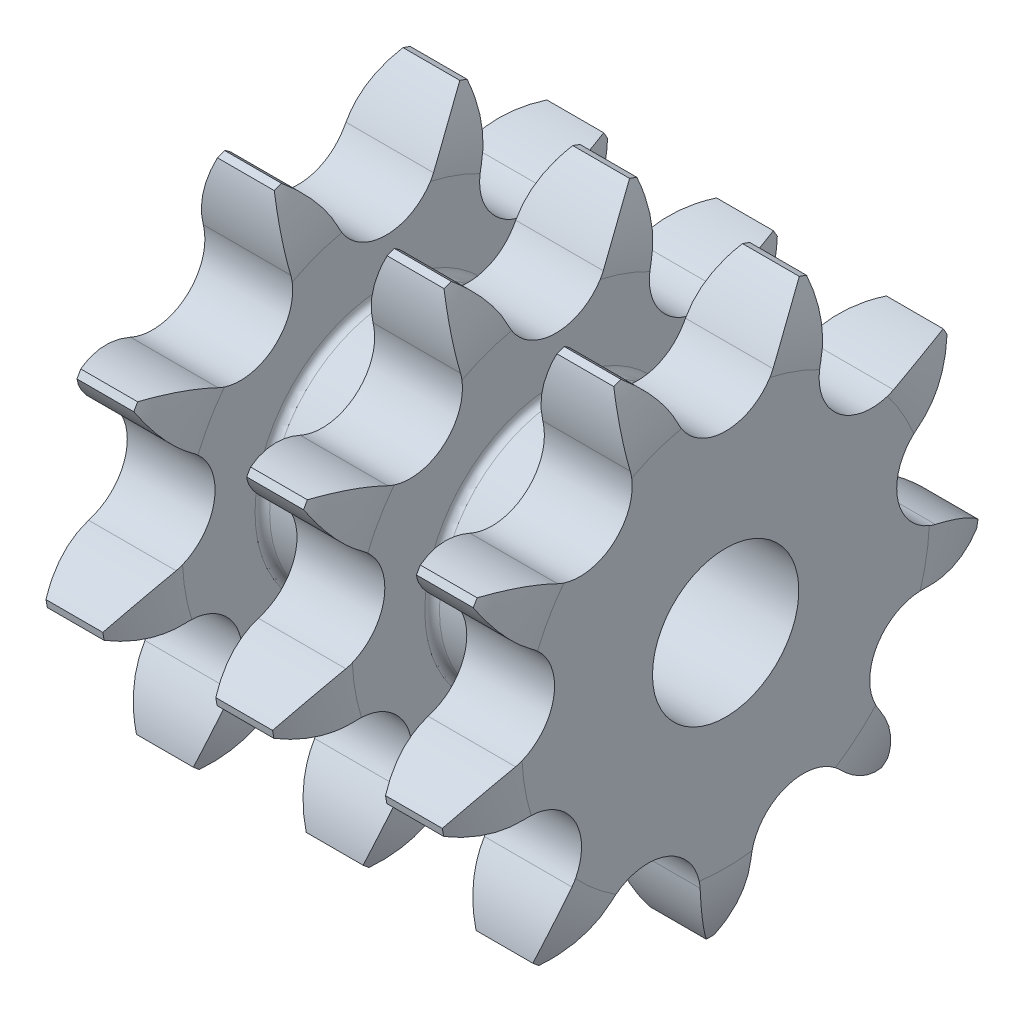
from build123d import *

# Parameters (mm, degrees)
GROOVES_COUNT   = 2
GROOVES_PITCH   = 13.92
TOOTHCUT_DEPTH  = 48.093600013
TEETHCUTS_COUNT = 9
TEETHCUTS_ANGLE = 320
BORSKE_R        = 6
BORE_DEPTH      = 37.2405


with BuildPart() as part:
    # BasProSke → Base-Revolve (revolve)
    with BuildSketch(Plane(origin=(0, 0, 0), x_dir=(1, 0, 0), z_dir=(0, 1, 0)), mode=Mode.PRIVATE) as base_revolve_sk:
        with BuildLine():
            Line((0, 0), (0, 16.712856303))
            ThreePointArc((0, 16.712856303), (0.321571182, 19.552662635), (1.27, 22.248657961))
            Line((1.27, 22.248657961), (33.77, 22.248657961))
            ThreePointArc((33.77, 22.248657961), (34.718428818, 19.552662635), (35.04, 16.712856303))
            Line((35.04, 16.712856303), (35.04, 0))
            Line((35.04, 0), (0, 0))
        make_face()
    revolve(base_revolve_sk.sketch.rotate(Axis((-10, 0, 0), (1, 0, 0)), 180), axis=Axis((-10, 0, 0), (1, 0, 0)))

    # GrvSke → Groove (revolve, cut)
    with BuildSketch(Plane(origin=(0, 0, 0), x_dir=(1, 0, 0), z_dir=(0, 1, 0)), mode=Mode.PRIVATE) as groove_sk:
        with BuildLine():
            Line((7.2, 16.712856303), (7.2, 10.751481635))
            ThreePointArc((7.2, 10.751481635), (7.375735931, 10.327217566), (7.8, 10.151481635))
            Line((7.8, 10.151481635), (13.32, 10.151481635))
            ThreePointArc((13.32, 10.151481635), (13.744264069, 10.327217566), (13.92, 10.751481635))
            Line((13.92, 10.751481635), (13.92, 16.712856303))
            ThreePointArc((13.92, 16.712856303), (14.241571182, 19.552662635), (15.19, 22.248657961))
            Line((15.19, 22.248657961), (5.93, 22.248657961))
            ThreePointArc((5.93, 22.248657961), (6.878428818, 19.552662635), (7.2, 16.712856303))
        make_face()
    groove = revolve(groove_sk.sketch.rotate(Axis((0, 0, 0), (1, 0, 0)), 180), axis=Axis((0, 0, 0), (1, 0, 0)), mode=Mode.SUBTRACT)

    # Grooves: Groove ×2
    with Locations(*[(i * GROOVES_PITCH, 0, 0) for i in range(1, GROOVES_COUNT)]):
        add(groove, mode=Mode.SUBTRACT)

    # TooCutSke → ToothCut (cut, through all)
    with BuildSketch(Plane(origin=(0, 0, 0), x_dir=(0, 0, -1), z_dir=(1, 0, 0))):
        with BuildLine():
            ThreePointArc((3.89490303, 16.792484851), (5.53909395, 19.346647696), (7.807509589, 21.366895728))
            ThreePointArc((7.807509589, 21.366895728), (0, 22.748657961), (-7.807509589, 21.366895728))
            ThreePointArc((-7.807509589, 21.366895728), (-5.53909395, 19.346647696), (-3.89490303, 16.792484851))
            ThreePointArc((-3.89490303, 16.792484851), (0, 14.311157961), (3.89490303, 16.792484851))
        make_face()
    toothcut = extrude(amount=TOOTHCUT_DEPTH, mode=Mode.SUBTRACT)

    # TeethCuts: ToothCut ×9 about axis
    teethcuts_axis = Axis((-10, 0, 0), (1, 0, 0))
    for i in range(1, TEETHCUTS_COUNT):
        add(toothcut.rotate(teethcuts_axis, i * TEETHCUTS_ANGLE / (TEETHCUTS_COUNT - 1)), mode=Mode.SUBTRACT)

    # BorSke → Bore (cut, symmetric)
    with BuildSketch(Plane(origin=(0, 0, 0), x_dir=(0, 0, -1), z_dir=(1, 0, 0))):
        with Locations(Location((0, 0, 0), (0, 0, 180))):
            Circle(BORSKE_R)
    extrude(amount=BORE_DEPTH, both=True, mode=Mode.SUBTRACT)


solid = part.part
